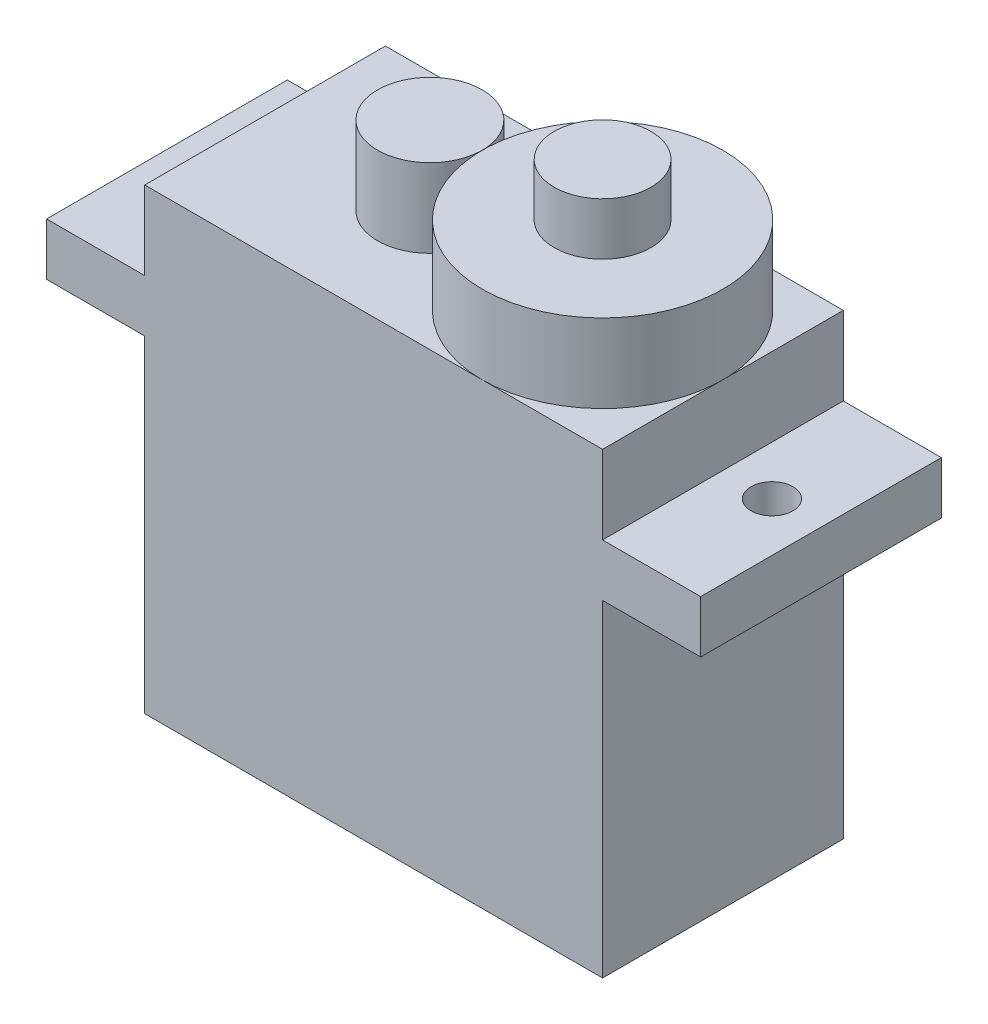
ISO-10303-21;
HEADER;
FILE_DESCRIPTION(('STEP AP214'),'2;1');
FILE_NAME('part.step','',(''),(''),'','','');
FILE_SCHEMA(('AUTOMOTIVE_DESIGN { 1 0 10303 214 1 1 1 1 }'));
ENDSEC;
DATA;
#1=APPLICATION_CONTEXT('core data for automotive mechanical design processes');
#2=APPLICATION_PROTOCOL_DEFINITION('international standard','automotive_design',2000,#1);
#3=PRODUCT_CONTEXT('',#1,'mechanical');
#4=PRODUCT('Part','Part','',(#3));
#5=PRODUCT_RELATED_PRODUCT_CATEGORY('part','',(#4));
#6=PRODUCT_DEFINITION_FORMATION('','',#4);
#7=PRODUCT_DEFINITION_CONTEXT('part definition',#1,'design');
#8=PRODUCT_DEFINITION('design','',#6,#7);
#9=PRODUCT_DEFINITION_SHAPE('','',#8);
#10=(LENGTH_UNIT() NAMED_UNIT(*) SI_UNIT(.MILLI.,.METRE.));
#11=(NAMED_UNIT(*) PLANE_ANGLE_UNIT() SI_UNIT($,.RADIAN.));
#12=(NAMED_UNIT(*) SI_UNIT($,.STERADIAN.) SOLID_ANGLE_UNIT());
#13=UNCERTAINTY_MEASURE_WITH_UNIT(LENGTH_MEASURE(1.E-05),#10,'distance_accuracy_value','');
#14=(GEOMETRIC_REPRESENTATION_CONTEXT(3) GLOBAL_UNCERTAINTY_ASSIGNED_CONTEXT((#13)) GLOBAL_UNIT_ASSIGNED_CONTEXT((#10,
#11,#12)) REPRESENTATION_CONTEXT('',''));
#15=CARTESIAN_POINT('',(0.,0.,0.));
#16=DIRECTION('',(0.,0.,1.));
#17=DIRECTION('',(1.,0.,0.));
#18=AXIS2_PLACEMENT_3D('',#15,#16,#17);
#19=CARTESIAN_POINT('',(21.1455,10.16,-5.842));
#20=DIRECTION('',(0.,-1.,0.));
#21=DIRECTION('',(0.,0.,-1.));
#22=AXIS2_PLACEMENT_3D('',#19,#20,#21);
#23=CYLINDRICAL_SURFACE('',#22,5.842);
#24=CARTESIAN_POINT('',(21.1455,10.16,-5.842));
#25=DIRECTION('',(0.,1.,0.));
#26=DIRECTION('',(0.,0.,1.));
#27=AXIS2_PLACEMENT_3D('',#24,#25,#26);
#28=CIRCLE('',#27,5.842);
#29=CARTESIAN_POINT('',(21.1455,10.16,-11.684));
#30=VERTEX_POINT('',#29);
#31=EDGE_CURVE('E11',#30,#30,#28,.T.);
#32=CARTESIAN_POINT('',(21.1455,6.35,-5.842));
#33=DIRECTION('',(0.,1.,0.));
#34=DIRECTION('',(0.,0.,1.));
#35=AXIS2_PLACEMENT_3D('',#32,#33,#34);
#36=CIRCLE('',#35,5.842);
#37=CARTESIAN_POINT('',(21.1455,6.35,-11.684));
#38=VERTEX_POINT('',#37);
#39=EDGE_CURVE('E45',#38,#38,#36,.T.);
#40=CARTESIAN_POINT('',(21.1455,10.16,-11.684));
#41=CARTESIAN_POINT('',(21.1455,10.1203125,-11.684));
#42=CARTESIAN_POINT('',(21.1455,10.080625,-11.684));
#43=CARTESIAN_POINT('',(21.1455,10.00125,-11.684));
#44=CARTESIAN_POINT('',(21.1455,9.9615625,-11.684));
#45=CARTESIAN_POINT('',(21.1455,9.8821875,-11.684));
#46=CARTESIAN_POINT('',(21.1455,9.8425,-11.684));
#47=CARTESIAN_POINT('',(21.1455,9.763125,-11.684));
#48=CARTESIAN_POINT('',(21.1455,9.7234375,-11.684));
#49=CARTESIAN_POINT('',(21.1455,9.6440625,-11.684));
#50=CARTESIAN_POINT('',(21.1455,9.604375,-11.684));
#51=CARTESIAN_POINT('',(21.1455,9.525,-11.684));
#52=CARTESIAN_POINT('',(21.1455,9.4853125,-11.684));
#53=CARTESIAN_POINT('',(21.1455,9.4059375,-11.684));
#54=CARTESIAN_POINT('',(21.1455,9.36625,-11.684));
#55=CARTESIAN_POINT('',(21.1455,9.286875,-11.684));
#56=CARTESIAN_POINT('',(21.1455,9.2471875,-11.684));
#57=CARTESIAN_POINT('',(21.1455,9.1678125,-11.684));
#58=CARTESIAN_POINT('',(21.1455,9.128125,-11.684));
#59=CARTESIAN_POINT('',(21.1455,9.04875,-11.684));
#60=CARTESIAN_POINT('',(21.1455,9.0090625,-11.684));
#61=CARTESIAN_POINT('',(21.1455,8.9296875,-11.684));
#62=CARTESIAN_POINT('',(21.1455,8.89,-11.684));
#63=CARTESIAN_POINT('',(21.1455,8.810625,-11.684));
#64=CARTESIAN_POINT('',(21.1455,8.7709375,-11.684));
#65=CARTESIAN_POINT('',(21.1455,8.6915625,-11.684));
#66=CARTESIAN_POINT('',(21.1455,8.651875,-11.684));
#67=CARTESIAN_POINT('',(21.1455,8.5725,-11.684));
#68=CARTESIAN_POINT('',(21.1455,8.5328125,-11.684));
#69=CARTESIAN_POINT('',(21.1455,8.4534375,-11.684));
#70=CARTESIAN_POINT('',(21.1455,8.41375,-11.684));
#71=CARTESIAN_POINT('',(21.1455,8.334375,-11.684));
#72=CARTESIAN_POINT('',(21.1455,8.2946875,-11.684));
#73=CARTESIAN_POINT('',(21.1455,8.2153125,-11.684));
#74=CARTESIAN_POINT('',(21.1455,8.175625,-11.684));
#75=CARTESIAN_POINT('',(21.1455,8.09625,-11.684));
#76=CARTESIAN_POINT('',(21.1455,8.0565625,-11.684));
#77=CARTESIAN_POINT('',(21.1455,7.9771875,-11.684));
#78=CARTESIAN_POINT('',(21.1455,7.9375,-11.684));
#79=CARTESIAN_POINT('',(21.1455,7.858125,-11.684));
#80=CARTESIAN_POINT('',(21.1455,7.8184375,-11.684));
#81=CARTESIAN_POINT('',(21.1455,7.7390625,-11.684));
#82=CARTESIAN_POINT('',(21.1455,7.699375,-11.684));
#83=CARTESIAN_POINT('',(21.1455,7.62,-11.684));
#84=CARTESIAN_POINT('',(21.1455,7.5803125,-11.684));
#85=CARTESIAN_POINT('',(21.1455,7.5009375,-11.684));
#86=CARTESIAN_POINT('',(21.1455,7.46125,-11.684));
#87=CARTESIAN_POINT('',(21.1455,7.381875,-11.684));
#88=CARTESIAN_POINT('',(21.1455,7.3421875,-11.684));
#89=CARTESIAN_POINT('',(21.1455,7.2628125,-11.684));
#90=CARTESIAN_POINT('',(21.1455,7.223125,-11.684));
#91=CARTESIAN_POINT('',(21.1455,7.14375,-11.684));
#92=CARTESIAN_POINT('',(21.1455,7.1040625,-11.684));
#93=CARTESIAN_POINT('',(21.1455,7.0246875,-11.684));
#94=CARTESIAN_POINT('',(21.1455,6.985,-11.684));
#95=CARTESIAN_POINT('',(21.1455,6.905625,-11.684));
#96=CARTESIAN_POINT('',(21.1455,6.8659375,-11.684));
#97=CARTESIAN_POINT('',(21.1455,6.7865625,-11.684));
#98=CARTESIAN_POINT('',(21.1455,6.746875,-11.684));
#99=CARTESIAN_POINT('',(21.1455,6.6675,-11.684));
#100=CARTESIAN_POINT('',(21.1455,6.6278125,-11.684));
#101=CARTESIAN_POINT('',(21.1455,6.5484375,-11.684));
#102=CARTESIAN_POINT('',(21.1455,6.50875,-11.684));
#103=CARTESIAN_POINT('',(21.1455,6.429375,-11.684));
#104=CARTESIAN_POINT('',(21.1455,6.3896875,-11.684));
#105=CARTESIAN_POINT('',(21.1455,6.35,-11.684));
#106=B_SPLINE_CURVE_WITH_KNOTS('',3,(#40,#41,#42,#43,#44,#45,#46,#47,#48,#49,#50,#51,#52,#53,
#54,#55,#56,#57,#58,#59,#60,#61,#62,#63,#64,#65,#66,#67,#68,#69,#70,#71,#72,#73,#74,#75,#76,#77,
#78,#79,#80,#81,#82,#83,#84,#85,#86,#87,#88,#89,#90,#91,#92,#93,#94,#95,#96,#97,#98,#99,#100,
#101,#102,#103,#104,#105),.UNSPECIFIED.,.F.,.F.,(4,2,2,2,2,2,2,2,2,2,2,2,2,2,2,2,2,2,2,2,2,2,2,
2,2,2,2,2,2,2,2,2,4),(0.,0.119062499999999,0.238124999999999,0.3571875,0.476249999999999,
0.595312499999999,0.714374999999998,0.833437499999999,0.952499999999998,1.0715625,1.190625,
1.3096875,1.42875,1.5478125,1.666875,1.7859375,1.905,2.0240625,2.143125,2.2621875,2.38125,
2.5003125,2.619375,2.7384375,2.8575,2.9765625,3.095625,3.2146875,3.33375,3.4528125,3.571875,
3.6909375,3.81),.UNSPECIFIED.);
#107=EDGE_CURVE('BSEAM42',#30,#38,#106,.T.);
#108=ORIENTED_EDGE('',*,*,#31,.F.);
#109=ORIENTED_EDGE('',*,*,#39,.T.);
#110=ORIENTED_EDGE('',*,*,#107,.T.);
#111=ORIENTED_EDGE('',*,*,#107,.F.);
#112=EDGE_LOOP('',(#108,#110,#109,#111));
#113=FACE_BOUND('',#112,.T.);
#114=ADVANCED_FACE('F42',(#113),#23,.T.);
#115=CARTESIAN_POINT('',(0.,10.16,0.));
#116=DIRECTION('',(0.,1.,0.));
#117=DIRECTION('',(0.,0.,1.));
#118=AXIS2_PLACEMENT_3D('',#115,#116,#117);
#119=PLANE('',#118);
#120=CARTESIAN_POINT('',(21.1455,10.16,-5.842));
#121=DIRECTION('',(0.,1.,0.));
#122=DIRECTION('',(0.,0.,1.));
#123=AXIS2_PLACEMENT_3D('',#120,#121,#122);
#124=CIRCLE('',#123,2.3495);
#125=CARTESIAN_POINT('',(21.1455,10.16,-3.4925));
#126=VERTEX_POINT('',#125);
#127=EDGE_CURVE('E54',#126,#126,#124,.T.);
#128=ORIENTED_EDGE('',*,*,#127,.F.);
#129=EDGE_LOOP('',(#128));
#130=FACE_BOUND('',#129,.T.);
#131=ORIENTED_EDGE('',*,*,#31,.T.);
#132=EDGE_LOOP('',(#131));
#133=FACE_BOUND('',#132,.T.);
#134=ADVANCED_FACE('F69',(#130,#133),#119,.T.);
#135=CARTESIAN_POINT('',(0.,6.35,0.));
#136=DIRECTION('',(0.,1.,0.));
#137=DIRECTION('',(0.,0.,1.));
#138=AXIS2_PLACEMENT_3D('',#135,#136,#137);
#139=PLANE('',#138);
#140=ORIENTED_EDGE('',*,*,#39,.F.);
#141=EDGE_LOOP('',(#140));
#142=FACE_BOUND('',#141,.T.);
#143=ADVANCED_FACE('F65',(#142),#139,.F.);
#144=CARTESIAN_POINT('',(21.1455,12.7,-5.842));
#145=DIRECTION('',(0.,-1.,0.));
#146=DIRECTION('',(0.,0.,-1.));
#147=AXIS2_PLACEMENT_3D('',#144,#145,#146);
#148=CYLINDRICAL_SURFACE('',#147,2.3495);
#149=CARTESIAN_POINT('',(21.1455,12.7,-5.842));
#150=DIRECTION('',(0.,1.,0.));
#151=DIRECTION('',(0.,0.,1.));
#152=AXIS2_PLACEMENT_3D('',#149,#150,#151);
#153=CIRCLE('',#152,2.3495);
#154=CARTESIAN_POINT('',(21.1455,12.7,-3.4925));
#155=VERTEX_POINT('',#154);
#156=EDGE_CURVE('E52',#155,#155,#153,.T.);
#157=ORIENTED_EDGE('',*,*,#156,.F.);
#158=EDGE_LOOP('',(#157));
#159=FACE_BOUND('',#158,.T.);
#160=ORIENTED_EDGE('',*,*,#127,.T.);
#161=EDGE_LOOP('',(#160));
#162=FACE_BOUND('',#161,.T.);
#163=ADVANCED_FACE('F62',(#159,#162),#148,.T.);
#164=CARTESIAN_POINT('',(21.1455,12.7,-5.842));
#165=DIRECTION('',(0.,1.,0.));
#166=DIRECTION('',(0.,0.,1.));
#167=AXIS2_PLACEMENT_3D('',#164,#165,#166);
#168=PLANE('',#167);
#169=ORIENTED_EDGE('',*,*,#156,.T.);
#170=EDGE_LOOP('',(#169));
#171=FACE_BOUND('',#170,.T.);
#172=ADVANCED_FACE('F60',(#171),#168,.T.);
#173=CLOSED_SHELL('',(#114,#134,#143,#163,#172));
#174=MANIFOLD_SOLID_BREP('B2',#173);
#175=CARTESIAN_POINT('',(0.,0.,0.));
#176=DIRECTION('',(0.,-1.,0.));
#177=DIRECTION('',(0.,0.,-1.));
#178=AXIS2_PLACEMENT_3D('',#175,#176,#177);
#179=PLANE('',#178);
#180=CARTESIAN_POINT('',(2.38125,0.,-5.842));
#181=DIRECTION('',(0.,-1.,0.));
#182=DIRECTION('',(0.,0.,-1.));
#183=AXIS2_PLACEMENT_3D('',#180,#181,#182);
#184=CIRCLE('',#183,1.016);
#185=CARTESIAN_POINT('',(2.38125,0.,-6.858));
#186=VERTEX_POINT('',#185);
#187=EDGE_CURVE('E337',#186,#186,#184,.T.);
#188=ORIENTED_EDGE('',*,*,#187,.F.);
#189=EDGE_LOOP('',(#188));
#190=FACE_BOUND('',#189,.T.);
#191=DIRECTION('',(0.,0.,-1.));
#192=VECTOR('',#191,1.);
#193=CARTESIAN_POINT('',(4.7625,0.,0.));
#194=LINE('',#193,#192);
#195=CARTESIAN_POINT('',(4.7625,0.,0.));
#196=VERTEX_POINT('',#195);
#197=CARTESIAN_POINT('',(4.7625,0.,-11.684));
#198=VERTEX_POINT('',#197);
#199=EDGE_CURVE('E129',#196,#198,#194,.T.);
#200=ORIENTED_EDGE('',*,*,#199,.F.);
#201=DIRECTION('',(1.,0.,0.));
#202=VECTOR('',#201,1.);
#203=CARTESIAN_POINT('',(0.,0.,0.));
#204=LINE('',#203,#202);
#205=CARTESIAN_POINT('',(0.,0.,0.));
#206=VERTEX_POINT('',#205);
#207=EDGE_CURVE('E276',#206,#196,#204,.T.);
#208=ORIENTED_EDGE('',*,*,#207,.F.);
#209=DIRECTION('',(0.,0.,1.));
#210=VECTOR('',#209,1.);
#211=CARTESIAN_POINT('',(0.,0.,0.));
#212=LINE('',#211,#210);
#213=CARTESIAN_POINT('',(0.,0.,-11.684));
#214=VERTEX_POINT('',#213);
#215=EDGE_CURVE('E259',#214,#206,#212,.T.);
#216=ORIENTED_EDGE('',*,*,#215,.F.);
#217=DIRECTION('',(-1.,0.,0.));
#218=VECTOR('',#217,1.);
#219=CARTESIAN_POINT('',(0.,0.,-11.684));
#220=LINE('',#219,#218);
#221=EDGE_CURVE('E134',#198,#214,#220,.T.);
#222=ORIENTED_EDGE('',*,*,#221,.F.);
#223=EDGE_LOOP('',(#200,#208,#216,#222));
#224=FACE_BOUND('',#223,.T.);
#225=ADVANCED_FACE('F113',(#190,#224),#179,.T.);
#226=CARTESIAN_POINT('',(0.,2.54,0.));
#227=DIRECTION('',(0.,-1.,0.));
#228=DIRECTION('',(0.,0.,-1.));
#229=AXIS2_PLACEMENT_3D('',#226,#227,#228);
#230=PLANE('',#229);
#231=CARTESIAN_POINT('',(2.38125,2.54,-5.842));
#232=DIRECTION('',(0.,1.,0.));
#233=DIRECTION('',(0.,0.,1.));
#234=AXIS2_PLACEMENT_3D('',#231,#232,#233);
#235=CIRCLE('',#234,1.016);
#236=CARTESIAN_POINT('',(2.38125,2.54,-4.826));
#237=VERTEX_POINT('',#236);
#238=EDGE_CURVE('E394',#237,#237,#235,.T.);
#239=ORIENTED_EDGE('',*,*,#238,.F.);
#240=EDGE_LOOP('',(#239));
#241=FACE_BOUND('',#240,.T.);
#242=DIRECTION('',(0.,0.,1.));
#243=VECTOR('',#242,1.);
#244=CARTESIAN_POINT('',(4.7625,2.54,0.));
#245=LINE('',#244,#243);
#246=CARTESIAN_POINT('',(4.7625,2.54,-11.684));
#247=VERTEX_POINT('',#246);
#248=CARTESIAN_POINT('',(4.7625,2.54,0.));
#249=VERTEX_POINT('',#248);
#250=EDGE_CURVE('E227',#247,#249,#245,.T.);
#251=ORIENTED_EDGE('',*,*,#250,.F.);
#252=DIRECTION('',(-1.,0.,0.));
#253=VECTOR('',#252,1.);
#254=CARTESIAN_POINT('',(0.,2.54,-11.684));
#255=LINE('',#254,#253);
#256=CARTESIAN_POINT('',(0.,2.54,-11.684));
#257=VERTEX_POINT('',#256);
#258=EDGE_CURVE('E269',#247,#257,#255,.T.);
#259=ORIENTED_EDGE('',*,*,#258,.T.);
#260=DIRECTION('',(0.,0.,1.));
#261=VECTOR('',#260,1.);
#262=CARTESIAN_POINT('',(0.,2.54,0.));
#263=LINE('',#262,#261);
#264=CARTESIAN_POINT('',(0.,2.54,0.));
#265=VERTEX_POINT('',#264);
#266=EDGE_CURVE('E260',#257,#265,#263,.T.);
#267=ORIENTED_EDGE('',*,*,#266,.T.);
#268=DIRECTION('',(1.,0.,0.));
#269=VECTOR('',#268,1.);
#270=CARTESIAN_POINT('',(0.,2.54,0.));
#271=LINE('',#270,#269);
#272=EDGE_CURVE('E265',#265,#249,#271,.T.);
#273=ORIENTED_EDGE('',*,*,#272,.T.);
#274=EDGE_LOOP('',(#251,#259,#267,#273));
#275=FACE_BOUND('',#274,.T.);
#276=ADVANCED_FACE('F297',(#241,#275),#230,.F.);
#277=CARTESIAN_POINT('',(29.36875,2.54,-5.842));
#278=DIRECTION('',(0.,1.,0.));
#279=DIRECTION('',(0.,0.,-1.));
#280=AXIS2_PLACEMENT_3D('',#277,#278,#279);
#281=CIRCLE('',#280,1.016);
#282=CARTESIAN_POINT('',(29.36875,2.54,-6.858));
#283=VERTEX_POINT('',#282);
#284=EDGE_CURVE('E391',#283,#283,#281,.T.);
#285=ORIENTED_EDGE('',*,*,#284,.F.);
#286=EDGE_LOOP('',(#285));
#287=FACE_BOUND('',#286,.T.);
#288=DIRECTION('',(0.,0.,-1.));
#289=VECTOR('',#288,1.);
#290=CARTESIAN_POINT('',(26.9875,2.54,0.));
#291=LINE('',#290,#289);
#292=CARTESIAN_POINT('',(26.9875,2.54,0.));
#293=VERTEX_POINT('',#292);
#294=CARTESIAN_POINT('',(26.9875,2.54,-11.684));
#295=VERTEX_POINT('',#294);
#296=EDGE_CURVE('E237',#293,#295,#291,.T.);
#297=ORIENTED_EDGE('',*,*,#296,.F.);
#298=CARTESIAN_POINT('',(31.75,2.54,0.));
#299=VERTEX_POINT('',#298);
#300=EDGE_CURVE('E263',#293,#299,#271,.T.);
#301=ORIENTED_EDGE('',*,*,#300,.T.);
#302=DIRECTION('',(0.,0.,-1.));
#303=VECTOR('',#302,1.);
#304=CARTESIAN_POINT('',(31.75,2.54,0.));
#305=LINE('',#304,#303);
#306=CARTESIAN_POINT('',(31.75,2.54,-11.684));
#307=VERTEX_POINT('',#306);
#308=EDGE_CURVE('E267',#299,#307,#305,.T.);
#309=ORIENTED_EDGE('',*,*,#308,.T.);
#310=EDGE_CURVE('E270',#307,#295,#255,.T.);
#311=ORIENTED_EDGE('',*,*,#310,.T.);
#312=EDGE_LOOP('',(#297,#301,#309,#311));
#313=FACE_BOUND('',#312,.T.);
#314=ADVANCED_FACE('F304',(#287,#313),#230,.F.);
#315=CARTESIAN_POINT('',(0.,2.54,0.));
#316=DIRECTION('',(1.,0.,0.));
#317=DIRECTION('',(0.,0.,-1.));
#318=AXIS2_PLACEMENT_3D('',#315,#316,#317);
#319=PLANE('',#318);
#320=ORIENTED_EDGE('',*,*,#215,.T.);
#321=DIRECTION('',(0.,-1.,0.));
#322=VECTOR('',#321,1.);
#323=CARTESIAN_POINT('',(0.,2.54,0.));
#324=LINE('',#323,#322);
#325=EDGE_CURVE('E122',#265,#206,#324,.T.);
#326=ORIENTED_EDGE('',*,*,#325,.F.);
#327=ORIENTED_EDGE('',*,*,#266,.F.);
#328=DIRECTION('',(0.,-1.,0.));
#329=VECTOR('',#328,1.);
#330=CARTESIAN_POINT('',(0.,2.54,-11.684));
#331=LINE('',#330,#329);
#332=EDGE_CURVE('E272',#257,#214,#331,.T.);
#333=ORIENTED_EDGE('',*,*,#332,.T.);
#334=EDGE_LOOP('',(#320,#326,#327,#333));
#335=FACE_BOUND('',#334,.T.);
#336=ADVANCED_FACE('F115',(#335),#319,.F.);
#337=CARTESIAN_POINT('',(0.,2.54,0.));
#338=DIRECTION('',(0.,0.,-1.));
#339=DIRECTION('',(-1.,0.,0.));
#340=AXIS2_PLACEMENT_3D('',#337,#338,#339);
#341=PLANE('',#340);
#342=ORIENTED_EDGE('',*,*,#207,.T.);
#343=DIRECTION('',(0.,1.,0.));
#344=VECTOR('',#343,1.);
#345=CARTESIAN_POINT('',(4.7625,-15.875,0.));
#346=LINE('',#345,#344);
#347=CARTESIAN_POINT('',(4.7625,-15.875,0.));
#348=VERTEX_POINT('',#347);
#349=EDGE_CURVE('E334',#348,#196,#346,.T.);
#350=ORIENTED_EDGE('',*,*,#349,.F.);
#351=DIRECTION('',(-1.,0.,0.));
#352=VECTOR('',#351,1.);
#353=CARTESIAN_POINT('',(4.7625,-15.875,0.));
#354=LINE('',#353,#352);
#355=CARTESIAN_POINT('',(26.9875,-15.875,0.));
#356=VERTEX_POINT('',#355);
#357=EDGE_CURVE('E217',#356,#348,#354,.T.);
#358=ORIENTED_EDGE('',*,*,#357,.F.);
#359=DIRECTION('',(0.,1.,0.));
#360=VECTOR('',#359,1.);
#361=CARTESIAN_POINT('',(26.9875,-15.875,0.));
#362=LINE('',#361,#360);
#363=CARTESIAN_POINT('',(26.9875,0.,0.));
#364=VERTEX_POINT('',#363);
#365=EDGE_CURVE('E229',#356,#364,#362,.T.);
#366=ORIENTED_EDGE('',*,*,#365,.T.);
#367=CARTESIAN_POINT('',(31.75,0.,0.));
#368=VERTEX_POINT('',#367);
#369=EDGE_CURVE('E275',#364,#368,#204,.T.);
#370=ORIENTED_EDGE('',*,*,#369,.T.);
#371=DIRECTION('',(0.,-1.,0.));
#372=VECTOR('',#371,1.);
#373=CARTESIAN_POINT('',(31.75,2.54,0.));
#374=LINE('',#373,#372);
#375=EDGE_CURVE('E286',#299,#368,#374,.T.);
#376=ORIENTED_EDGE('',*,*,#375,.F.);
#377=ORIENTED_EDGE('',*,*,#300,.F.);
#378=DIRECTION('',(0.,-1.,0.));
#379=VECTOR('',#378,1.);
#380=CARTESIAN_POINT('',(26.9875,6.35,0.));
#381=LINE('',#380,#379);
#382=CARTESIAN_POINT('',(26.9875,6.35,0.));
#383=VERTEX_POINT('',#382);
#384=EDGE_CURVE('E253',#383,#293,#381,.T.);
#385=ORIENTED_EDGE('',*,*,#384,.F.);
#386=DIRECTION('',(1.,0.,0.));
#387=VECTOR('',#386,1.);
#388=CARTESIAN_POINT('',(4.7625,6.35,0.));
#389=LINE('',#388,#387);
#390=CARTESIAN_POINT('',(4.7625,6.35,0.));
#391=VERTEX_POINT('',#390);
#392=EDGE_CURVE('E236',#391,#383,#389,.T.);
#393=ORIENTED_EDGE('',*,*,#392,.F.);
#394=DIRECTION('',(0.,-1.,0.));
#395=VECTOR('',#394,1.);
#396=CARTESIAN_POINT('',(4.7625,6.35,0.));
#397=LINE('',#396,#395);
#398=EDGE_CURVE('E256',#391,#249,#397,.T.);
#399=ORIENTED_EDGE('',*,*,#398,.T.);
#400=ORIENTED_EDGE('',*,*,#272,.F.);
#401=ORIENTED_EDGE('',*,*,#325,.T.);
#402=EDGE_LOOP('',(#342,#350,#358,#366,#370,#376,#377,#385,#393,#399,#400,#401));
#403=FACE_BOUND('',#402,.T.);
#404=ADVANCED_FACE('F292',(#403),#341,.F.);
#405=CARTESIAN_POINT('',(31.75,2.54,0.));
#406=DIRECTION('',(-1.,0.,0.));
#407=DIRECTION('',(0.,0.,1.));
#408=AXIS2_PLACEMENT_3D('',#405,#406,#407);
#409=PLANE('',#408);
#410=DIRECTION('',(0.,0.,-1.));
#411=VECTOR('',#410,1.);
#412=CARTESIAN_POINT('',(31.75,0.,0.));
#413=LINE('',#412,#411);
#414=CARTESIAN_POINT('',(31.75,0.,-11.684));
#415=VERTEX_POINT('',#414);
#416=EDGE_CURVE('E278',#368,#415,#413,.T.);
#417=ORIENTED_EDGE('',*,*,#416,.T.);
#418=DIRECTION('',(0.,-1.,0.));
#419=VECTOR('',#418,1.);
#420=CARTESIAN_POINT('',(31.75,2.54,-11.684));
#421=LINE('',#420,#419);
#422=EDGE_CURVE('E283',#307,#415,#421,.T.);
#423=ORIENTED_EDGE('',*,*,#422,.F.);
#424=ORIENTED_EDGE('',*,*,#308,.F.);
#425=ORIENTED_EDGE('',*,*,#375,.T.);
#426=EDGE_LOOP('',(#417,#423,#424,#425));
#427=FACE_BOUND('',#426,.T.);
#428=ADVANCED_FACE('F319',(#427),#409,.F.);
#429=CARTESIAN_POINT('',(0.,2.54,-11.684));
#430=DIRECTION('',(0.,0.,1.));
#431=DIRECTION('',(1.,0.,0.));
#432=AXIS2_PLACEMENT_3D('',#429,#430,#431);
#433=PLANE('',#432);
#434=CARTESIAN_POINT('',(26.9875,0.,-11.684));
#435=VERTEX_POINT('',#434);
#436=EDGE_CURVE('E264',#415,#435,#220,.T.);
#437=ORIENTED_EDGE('',*,*,#436,.T.);
#438=DIRECTION('',(0.,1.,0.));
#439=VECTOR('',#438,1.);
#440=CARTESIAN_POINT('',(26.9875,-15.875,-11.684));
#441=LINE('',#440,#439);
#442=CARTESIAN_POINT('',(26.9875,-15.875,-11.684));
#443=VERTEX_POINT('',#442);
#444=EDGE_CURVE('E208',#443,#435,#441,.T.);
#445=ORIENTED_EDGE('',*,*,#444,.F.);
#446=DIRECTION('',(1.,0.,0.));
#447=VECTOR('',#446,1.);
#448=CARTESIAN_POINT('',(4.7625,-15.875,-11.684));
#449=LINE('',#448,#447);
#450=CARTESIAN_POINT('',(4.7625,-15.875,-11.684));
#451=VERTEX_POINT('',#450);
#452=EDGE_CURVE('E201',#451,#443,#449,.T.);
#453=ORIENTED_EDGE('',*,*,#452,.F.);
#454=DIRECTION('',(0.,1.,0.));
#455=VECTOR('',#454,1.);
#456=CARTESIAN_POINT('',(4.7625,-15.875,-11.684));
#457=LINE('',#456,#455);
#458=EDGE_CURVE('E206',#451,#198,#457,.T.);
#459=ORIENTED_EDGE('',*,*,#458,.T.);
#460=ORIENTED_EDGE('',*,*,#221,.T.);
#461=ORIENTED_EDGE('',*,*,#332,.F.);
#462=ORIENTED_EDGE('',*,*,#258,.F.);
#463=DIRECTION('',(0.,-1.,0.));
#464=VECTOR('',#463,1.);
#465=CARTESIAN_POINT('',(4.7625,6.35,-11.684));
#466=LINE('',#465,#464);
#467=CARTESIAN_POINT('',(4.7625,6.35,-11.684));
#468=VERTEX_POINT('',#467);
#469=EDGE_CURVE('E243',#468,#247,#466,.T.);
#470=ORIENTED_EDGE('',*,*,#469,.F.);
#471=DIRECTION('',(-1.,0.,0.));
#472=VECTOR('',#471,1.);
#473=CARTESIAN_POINT('',(4.7625,6.35,-11.684));
#474=LINE('',#473,#472);
#475=CARTESIAN_POINT('',(26.9875,6.35,-11.684));
#476=VERTEX_POINT('',#475);
#477=EDGE_CURVE('E241',#476,#468,#474,.T.);
#478=ORIENTED_EDGE('',*,*,#477,.F.);
#479=DIRECTION('',(0.,-1.,0.));
#480=VECTOR('',#479,1.);
#481=CARTESIAN_POINT('',(26.9875,6.35,-11.684));
#482=LINE('',#481,#480);
#483=EDGE_CURVE('E250',#476,#295,#482,.T.);
#484=ORIENTED_EDGE('',*,*,#483,.T.);
#485=ORIENTED_EDGE('',*,*,#310,.F.);
#486=ORIENTED_EDGE('',*,*,#422,.T.);
#487=EDGE_LOOP('',(#437,#445,#453,#459,#460,#461,#462,#470,#478,#484,#485,#486));
#488=FACE_BOUND('',#487,.T.);
#489=ADVANCED_FACE('F204',(#488),#433,.F.);
#490=CARTESIAN_POINT('',(29.36875,0.,-5.842));
#491=DIRECTION('',(0.,-1.,0.));
#492=DIRECTION('',(0.,0.,-1.));
#493=AXIS2_PLACEMENT_3D('',#490,#491,#492);
#494=CIRCLE('',#493,1.016);
#495=CARTESIAN_POINT('',(29.36875,0.,-6.858));
#496=VERTEX_POINT('',#495);
#497=EDGE_CURVE('E117',#496,#496,#494,.T.);
#498=ORIENTED_EDGE('',*,*,#497,.F.);
#499=EDGE_LOOP('',(#498));
#500=FACE_BOUND('',#499,.T.);
#501=DIRECTION('',(0.,0.,1.));
#502=VECTOR('',#501,1.);
#503=CARTESIAN_POINT('',(26.9875,0.,0.));
#504=LINE('',#503,#502);
#505=EDGE_CURVE('E221',#435,#364,#504,.T.);
#506=ORIENTED_EDGE('',*,*,#505,.F.);
#507=ORIENTED_EDGE('',*,*,#436,.F.);
#508=ORIENTED_EDGE('',*,*,#416,.F.);
#509=ORIENTED_EDGE('',*,*,#369,.F.);
#510=EDGE_LOOP('',(#506,#507,#508,#509));
#511=FACE_BOUND('',#510,.T.);
#512=ADVANCED_FACE('F300',(#500,#511),#179,.T.);
#513=CARTESIAN_POINT('',(4.7625,6.35,0.));
#514=DIRECTION('',(1.,0.,0.));
#515=DIRECTION('',(0.,0.,-1.));
#516=AXIS2_PLACEMENT_3D('',#513,#514,#515);
#517=PLANE('',#516);
#518=ORIENTED_EDGE('',*,*,#250,.T.);
#519=ORIENTED_EDGE('',*,*,#398,.F.);
#520=DIRECTION('',(0.,0.,1.));
#521=VECTOR('',#520,1.);
#522=CARTESIAN_POINT('',(4.7625,6.35,0.));
#523=LINE('',#522,#521);
#524=EDGE_CURVE('E233',#468,#391,#523,.T.);
#525=ORIENTED_EDGE('',*,*,#524,.F.);
#526=ORIENTED_EDGE('',*,*,#469,.T.);
#527=EDGE_LOOP('',(#518,#519,#525,#526));
#528=FACE_BOUND('',#527,.T.);
#529=ADVANCED_FACE('F310',(#528),#517,.F.);
#530=CARTESIAN_POINT('',(26.9875,6.35,0.));
#531=DIRECTION('',(-1.,0.,0.));
#532=DIRECTION('',(0.,0.,1.));
#533=AXIS2_PLACEMENT_3D('',#530,#531,#532);
#534=PLANE('',#533);
#535=ORIENTED_EDGE('',*,*,#296,.T.);
#536=ORIENTED_EDGE('',*,*,#483,.F.);
#537=DIRECTION('',(0.,0.,-1.));
#538=VECTOR('',#537,1.);
#539=CARTESIAN_POINT('',(26.9875,6.35,0.));
#540=LINE('',#539,#538);
#541=EDGE_CURVE('E239',#383,#476,#540,.T.);
#542=ORIENTED_EDGE('',*,*,#541,.F.);
#543=ORIENTED_EDGE('',*,*,#384,.T.);
#544=EDGE_LOOP('',(#535,#536,#542,#543));
#545=FACE_BOUND('',#544,.T.);
#546=ADVANCED_FACE('F316',(#545),#534,.F.);
#547=CARTESIAN_POINT('',(0.,6.35,0.));
#548=DIRECTION('',(0.,-1.,0.));
#549=DIRECTION('',(0.,0.,-1.));
#550=AXIS2_PLACEMENT_3D('',#547,#548,#549);
#551=PLANE('',#550);
#552=CARTESIAN_POINT('',(12.7635,6.35,-5.842));
#553=DIRECTION('',(0.,-1.,0.));
#554=DIRECTION('',(0.,0.,-1.));
#555=AXIS2_PLACEMENT_3D('',#552,#553,#554);
#556=CIRCLE('',#555,2.54);
#557=CARTESIAN_POINT('',(12.7635,6.35,-8.382));
#558=VERTEX_POINT('',#557);
#559=EDGE_CURVE('E40',#558,#558,#556,.F.);
#560=ORIENTED_EDGE('',*,*,#559,.F.);
#561=EDGE_LOOP('',(#560));
#562=FACE_BOUND('',#561,.T.);
#563=ORIENTED_EDGE('',*,*,#524,.T.);
#564=ORIENTED_EDGE('',*,*,#392,.T.);
#565=ORIENTED_EDGE('',*,*,#541,.T.);
#566=ORIENTED_EDGE('',*,*,#477,.T.);
#567=EDGE_LOOP('',(#563,#564,#565,#566));
#568=FACE_BOUND('',#567,.T.);
#569=ADVANCED_FACE('F350',(#562,#568),#551,.F.);
#570=CARTESIAN_POINT('',(12.7635,10.16,-5.842));
#571=DIRECTION('',(0.,-1.,0.));
#572=DIRECTION('',(0.,0.,-1.));
#573=AXIS2_PLACEMENT_3D('',#570,#571,#572);
#574=CYLINDRICAL_SURFACE('',#573,2.54);
#575=CARTESIAN_POINT('',(12.7635,10.16,-5.842));
#576=DIRECTION('',(0.,1.,0.));
#577=DIRECTION('',(0.,0.,1.));
#578=AXIS2_PLACEMENT_3D('',#575,#576,#577);
#579=CIRCLE('',#578,2.54);
#580=CARTESIAN_POINT('',(12.7635,10.16,-8.382));
#581=VERTEX_POINT('',#580);
#582=EDGE_CURVE('E224',#581,#581,#579,.T.);
#583=CARTESIAN_POINT('',(12.7635,10.16,-8.382));
#584=CARTESIAN_POINT('',(12.7635,10.1203125,-8.382));
#585=CARTESIAN_POINT('',(12.7635,10.080625,-8.382));
#586=CARTESIAN_POINT('',(12.7635,10.00125,-8.382));
#587=CARTESIAN_POINT('',(12.7635,9.9615625,-8.382));
#588=CARTESIAN_POINT('',(12.7635,9.8821875,-8.382));
#589=CARTESIAN_POINT('',(12.7635,9.8425,-8.382));
#590=CARTESIAN_POINT('',(12.7635,9.763125,-8.382));
#591=CARTESIAN_POINT('',(12.7635,9.7234375,-8.382));
#592=CARTESIAN_POINT('',(12.7635,9.6440625,-8.382));
#593=CARTESIAN_POINT('',(12.7635,9.604375,-8.382));
#594=CARTESIAN_POINT('',(12.7635,9.525,-8.382));
#595=CARTESIAN_POINT('',(12.7635,9.4853125,-8.382));
#596=CARTESIAN_POINT('',(12.7635,9.4059375,-8.382));
#597=CARTESIAN_POINT('',(12.7635,9.36625,-8.382));
#598=CARTESIAN_POINT('',(12.7635,9.286875,-8.382));
#599=CARTESIAN_POINT('',(12.7635,9.2471875,-8.382));
#600=CARTESIAN_POINT('',(12.7635,9.1678125,-8.382));
#601=CARTESIAN_POINT('',(12.7635,9.128125,-8.382));
#602=CARTESIAN_POINT('',(12.7635,9.04875,-8.382));
#603=CARTESIAN_POINT('',(12.7635,9.0090625,-8.382));
#604=CARTESIAN_POINT('',(12.7635,8.9296875,-8.382));
#605=CARTESIAN_POINT('',(12.7635,8.89,-8.382));
#606=CARTESIAN_POINT('',(12.7635,8.810625,-8.382));
#607=CARTESIAN_POINT('',(12.7635,8.7709375,-8.382));
#608=CARTESIAN_POINT('',(12.7635,8.6915625,-8.382));
#609=CARTESIAN_POINT('',(12.7635,8.651875,-8.382));
#610=CARTESIAN_POINT('',(12.7635,8.5725,-8.382));
#611=CARTESIAN_POINT('',(12.7635,8.5328125,-8.382));
#612=CARTESIAN_POINT('',(12.7635,8.4534375,-8.382));
#613=CARTESIAN_POINT('',(12.7635,8.41375,-8.382));
#614=CARTESIAN_POINT('',(12.7635,8.334375,-8.382));
#615=CARTESIAN_POINT('',(12.7635,8.2946875,-8.382));
#616=CARTESIAN_POINT('',(12.7635,8.2153125,-8.382));
#617=CARTESIAN_POINT('',(12.7635,8.175625,-8.382));
#618=CARTESIAN_POINT('',(12.7635,8.09625,-8.382));
#619=CARTESIAN_POINT('',(12.7635,8.0565625,-8.382));
#620=CARTESIAN_POINT('',(12.7635,7.9771875,-8.382));
#621=CARTESIAN_POINT('',(12.7635,7.9375,-8.382));
#622=CARTESIAN_POINT('',(12.7635,7.858125,-8.382));
#623=CARTESIAN_POINT('',(12.7635,7.8184375,-8.382));
#624=CARTESIAN_POINT('',(12.7635,7.7390625,-8.382));
#625=CARTESIAN_POINT('',(12.7635,7.699375,-8.382));
#626=CARTESIAN_POINT('',(12.7635,7.62,-8.382));
#627=CARTESIAN_POINT('',(12.7635,7.5803125,-8.382));
#628=CARTESIAN_POINT('',(12.7635,7.5009375,-8.382));
#629=CARTESIAN_POINT('',(12.7635,7.46125,-8.382));
#630=CARTESIAN_POINT('',(12.7635,7.381875,-8.382));
#631=CARTESIAN_POINT('',(12.7635,7.3421875,-8.382));
#632=CARTESIAN_POINT('',(12.7635,7.2628125,-8.382));
#633=CARTESIAN_POINT('',(12.7635,7.223125,-8.382));
#634=CARTESIAN_POINT('',(12.7635,7.14375,-8.382));
#635=CARTESIAN_POINT('',(12.7635,7.1040625,-8.382));
#636=CARTESIAN_POINT('',(12.7635,7.0246875,-8.382));
#637=CARTESIAN_POINT('',(12.7635,6.985,-8.382));
#638=CARTESIAN_POINT('',(12.7635,6.905625,-8.382));
#639=CARTESIAN_POINT('',(12.7635,6.8659375,-8.382));
#640=CARTESIAN_POINT('',(12.7635,6.7865625,-8.382));
#641=CARTESIAN_POINT('',(12.7635,6.746875,-8.382));
#642=CARTESIAN_POINT('',(12.7635,6.6675,-8.382));
#643=CARTESIAN_POINT('',(12.7635,6.6278125,-8.382));
#644=CARTESIAN_POINT('',(12.7635,6.5484375,-8.382));
#645=CARTESIAN_POINT('',(12.7635,6.50875,-8.382));
#646=CARTESIAN_POINT('',(12.7635,6.429375,-8.382));
#647=CARTESIAN_POINT('',(12.7635,6.3896875,-8.382));
#648=CARTESIAN_POINT('',(12.7635,6.35,-8.382));
#649=B_SPLINE_CURVE_WITH_KNOTS('',3,(#583,#584,#585,#586,#587,#588,#589,#590,#591,#592,#593,
#594,#595,#596,#597,#598,#599,#600,#601,#602,#603,#604,#605,#606,#607,#608,#609,#610,#611,#612,
#613,#614,#615,#616,#617,#618,#619,#620,#621,#622,#623,#624,#625,#626,#627,#628,#629,#630,#631,
#632,#633,#634,#635,#636,#637,#638,#639,#640,#641,#642,#643,#644,#645,#646,#647,#648),
.UNSPECIFIED.,.F.,.F.,(4,2,2,2,2,2,2,2,2,2,2,2,2,2,2,2,2,2,2,2,2,2,2,2,2,2,2,2,2,2,2,2,4),(0.,
0.119062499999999,0.238124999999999,0.357187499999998,0.476249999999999,0.595312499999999,
0.714374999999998,0.833437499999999,0.952499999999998,1.0715625,1.190625,1.3096875,1.42875,
1.5478125,1.666875,1.7859375,1.905,2.0240625,2.143125,2.2621875,2.38125,2.5003125,2.619375,
2.7384375,2.8575,2.9765625,3.095625,3.2146875,3.33375,3.4528125,3.571875,3.6909375,3.81),.UNSPECIFIED.);
#650=EDGE_CURVE('BSEAM357',#581,#558,#649,.T.);
#651=ORIENTED_EDGE('',*,*,#582,.F.);
#652=ORIENTED_EDGE('',*,*,#559,.T.);
#653=ORIENTED_EDGE('',*,*,#650,.T.);
#654=ORIENTED_EDGE('',*,*,#650,.F.);
#655=EDGE_LOOP('',(#651,#653,#652,#654));
#656=FACE_BOUND('',#655,.T.);
#657=ADVANCED_FACE('F357',(#656),#574,.T.);
#658=CARTESIAN_POINT('',(0.,10.16,0.));
#659=DIRECTION('',(0.,1.,0.));
#660=DIRECTION('',(0.,0.,1.));
#661=AXIS2_PLACEMENT_3D('',#658,#659,#660);
#662=PLANE('',#661);
#663=ORIENTED_EDGE('',*,*,#582,.T.);
#664=EDGE_LOOP('',(#663));
#665=FACE_BOUND('',#664,.T.);
#666=ADVANCED_FACE('F364',(#665),#662,.T.);
#667=CARTESIAN_POINT('',(4.7625,-15.875,0.));
#668=DIRECTION('',(1.,0.,0.));
#669=DIRECTION('',(0.,0.,-1.));
#670=AXIS2_PLACEMENT_3D('',#667,#668,#669);
#671=PLANE('',#670);
#672=ORIENTED_EDGE('',*,*,#199,.T.);
#673=ORIENTED_EDGE('',*,*,#458,.F.);
#674=DIRECTION('',(0.,0.,-1.));
#675=VECTOR('',#674,1.);
#676=CARTESIAN_POINT('',(4.7625,-15.875,0.));
#677=LINE('',#676,#675);
#678=EDGE_CURVE('E212',#348,#451,#677,.T.);
#679=ORIENTED_EDGE('',*,*,#678,.F.);
#680=ORIENTED_EDGE('',*,*,#349,.T.);
#681=EDGE_LOOP('',(#672,#673,#679,#680));
#682=FACE_BOUND('',#681,.T.);
#683=ADVANCED_FACE('F223',(#682),#671,.F.);
#684=CARTESIAN_POINT('',(26.9875,-15.875,0.));
#685=DIRECTION('',(-1.,0.,0.));
#686=DIRECTION('',(0.,0.,1.));
#687=AXIS2_PLACEMENT_3D('',#684,#685,#686);
#688=PLANE('',#687);
#689=ORIENTED_EDGE('',*,*,#505,.T.);
#690=ORIENTED_EDGE('',*,*,#365,.F.);
#691=DIRECTION('',(0.,0.,1.));
#692=VECTOR('',#691,1.);
#693=CARTESIAN_POINT('',(26.9875,-15.875,0.));
#694=LINE('',#693,#692);
#695=EDGE_CURVE('E211',#443,#356,#694,.T.);
#696=ORIENTED_EDGE('',*,*,#695,.F.);
#697=ORIENTED_EDGE('',*,*,#444,.T.);
#698=EDGE_LOOP('',(#689,#690,#696,#697));
#699=FACE_BOUND('',#698,.T.);
#700=ADVANCED_FACE('F332',(#699),#688,.F.);
#701=CARTESIAN_POINT('',(0.,-15.875,0.));
#702=DIRECTION('',(0.,-1.,0.));
#703=DIRECTION('',(0.,0.,-1.));
#704=AXIS2_PLACEMENT_3D('',#701,#702,#703);
#705=PLANE('',#704);
#706=ORIENTED_EDGE('',*,*,#678,.T.);
#707=ORIENTED_EDGE('',*,*,#452,.T.);
#708=ORIENTED_EDGE('',*,*,#695,.T.);
#709=ORIENTED_EDGE('',*,*,#357,.T.);
#710=EDGE_LOOP('',(#706,#707,#708,#709));
#711=FACE_BOUND('',#710,.T.);
#712=ADVANCED_FACE('F215',(#711),#705,.T.);
#713=CARTESIAN_POINT('',(2.38125,-15.875,-5.842));
#714=DIRECTION('',(0.,1.,0.));
#715=DIRECTION('',(0.,0.,1.));
#716=AXIS2_PLACEMENT_3D('',#713,#714,#715);
#717=CYLINDRICAL_SURFACE('',#716,1.016);
#718=ORIENTED_EDGE('',*,*,#187,.T.);
#719=EDGE_LOOP('',(#718));
#720=FACE_BOUND('',#719,.T.);
#721=ORIENTED_EDGE('',*,*,#238,.T.);
#722=EDGE_LOOP('',(#721));
#723=FACE_BOUND('',#722,.T.);
#724=ADVANCED_FACE('F379',(#720,#723),#717,.F.);
#725=CARTESIAN_POINT('',(29.36875,-15.875,-5.842));
#726=DIRECTION('',(0.,1.,0.));
#727=DIRECTION('',(0.,0.,1.));
#728=AXIS2_PLACEMENT_3D('',#725,#726,#727);
#729=CYLINDRICAL_SURFACE('',#728,1.016);
#730=ORIENTED_EDGE('',*,*,#497,.T.);
#731=EDGE_LOOP('',(#730));
#732=FACE_BOUND('',#731,.T.);
#733=ORIENTED_EDGE('',*,*,#284,.T.);
#734=EDGE_LOOP('',(#733));
#735=FACE_BOUND('',#734,.T.);
#736=ADVANCED_FACE('F382',(#732,#735),#729,.F.);
#737=CLOSED_SHELL('',(#225,#276,#314,#336,#404,#428,#489,#512,#529,#546,#569,#657,#666,#683,
#700,#712,#724,#736));
#738=MANIFOLD_SOLID_BREP('B6',#737);
#739=ADVANCED_BREP_SHAPE_REPRESENTATION('',(#18,#174,#738),#14);
#740=SHAPE_DEFINITION_REPRESENTATION(#9,#739);
ENDSEC;
END-ISO-10303-21;
